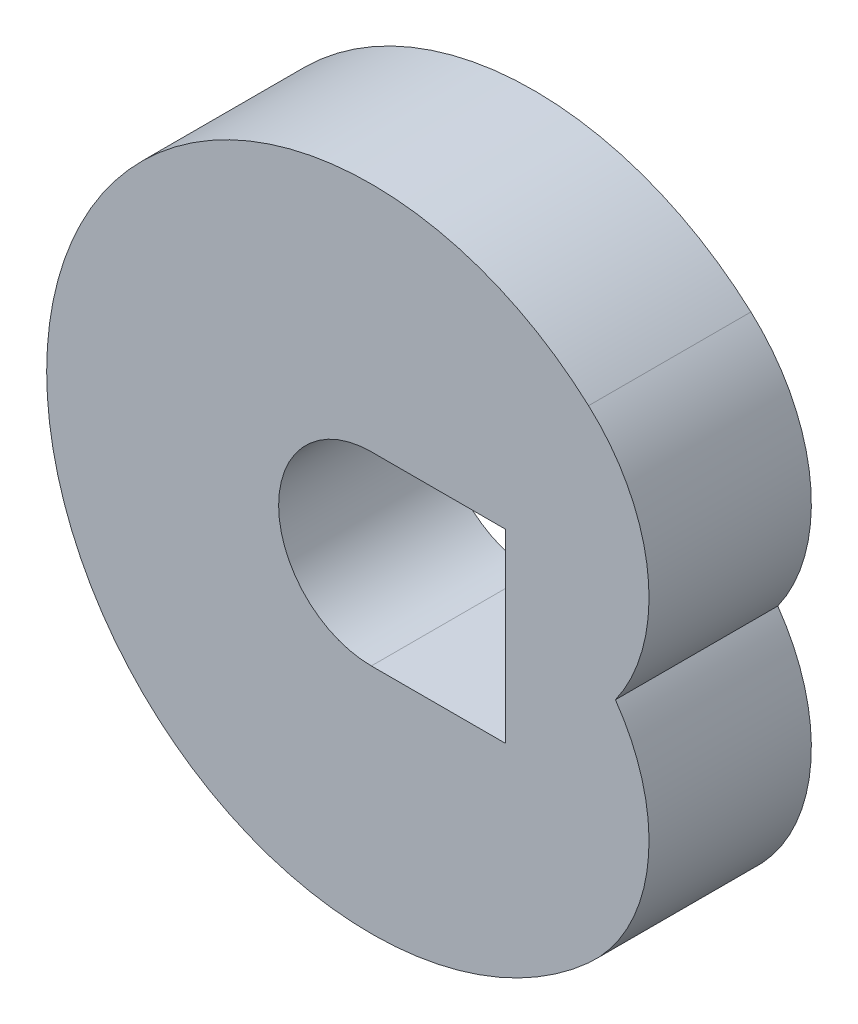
from build123d import *

# Parameters (mm, degrees)
EXTRUDE_1_DEPTH = 400


with BuildPart() as part:
    # Sketch 1 → Extrude 1 (new body)
    with BuildSketch(Plane.XY):
        with BuildLine():
            ThreePointArc((535.304485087, 594.515860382), (-800, 0), (535.304485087, -594.515860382))
            ThreePointArc((535.304485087, -594.515860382), (681.439265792, -309.832004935), (601.411768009, 0))
            ThreePointArc((601.411768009, 0), (681.439265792, 309.832004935), (535.304485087, 594.515860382))
        make_face()
        with BuildLine():
            Line((0, 228.477565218), (330, 228.477565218))
            Line((330, 228.477565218), (330, -228.477565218))
            Line((330, -228.477565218), (0, -228.477565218))
            ThreePointArc((0, -228.477565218), (-228.477565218, 0), (0, 228.477565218))
        make_face(mode=Mode.SUBTRACT)
    extrude(amount=EXTRUDE_1_DEPTH)


solid = part.part
